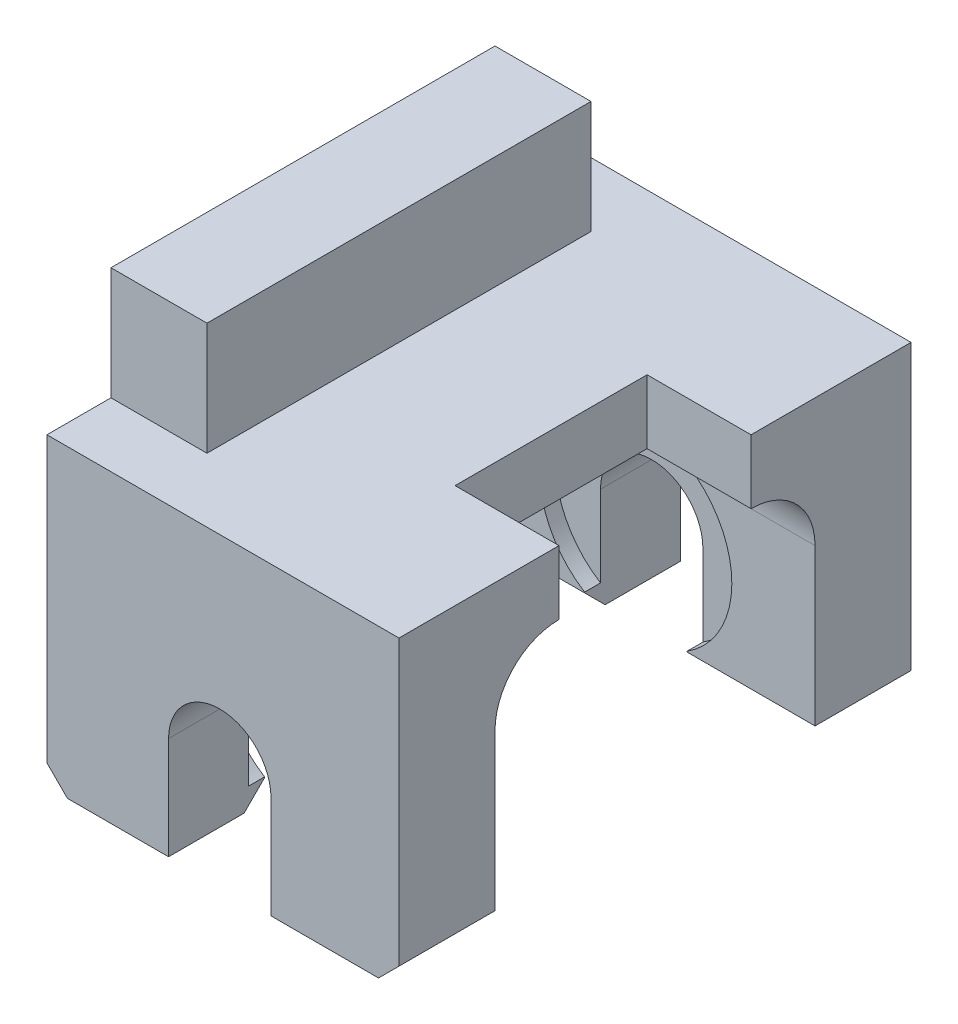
from build123d import *

# Parameters (mm, degrees)
BASE_EXTRUDE_DEPTH      = 25.4
BASE_EXTRUDE_DEPTH_BACK = 25.4
SKETCH2_W               = 31.75
SKETCH2_H               = 23.876
CUT_EXTRUDE1_DEPTH      = 54.300827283
SKETCH3_W               = 10.3124
SKETCH3_H               = 19.05
CUT_EXTRUDE2_DEPTH      = 44.300109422
FILLET1_R               = 6.35
CHAMFER1_SIZE           = 2.032
SKETCH5_R               = 9.525
CUT_EXTRUDE4_DEPTH      = 1.5748
SKETCH4_W               = 6.35
SKETCH4_H               = 11.176
CUT_EXTRUDE3_DEPTH      = 48.606539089


with BuildPart() as part:
    # Sketch1 → Base-Extrude (new, two sides: drawn at the far end of the back side and taken through both)
    with BuildSketch(Plane.XY.offset(-BASE_EXTRUDE_DEPTH_BACK)):
        with BuildLine():
            Line((-17.145, -10.16), (-17.145, 31.242))
            Line((-17.145, 31.242), (-7.62, 31.242))
            Line((-7.62, 31.242), (-7.62, 20.066))
            Line((-7.62, 20.066), (17.78, 20.066))
            Line((17.78, 20.066), (17.78, -10.16))
            Line((17.78, -10.16), (5.08, -10.16))
            Line((5.08, -10.16), (5.08, 0))
            ThreePointArc((5.08, 0), (0, 5.08), (-5.08, 0))
            Line((-5.08, 0), (-5.08, -10.16))
            Line((-5.08, -10.16), (-17.145, -10.16))
        make_face()
    extrude(amount=BASE_EXTRUDE_DEPTH + BASE_EXTRUDE_DEPTH_BACK)

    # Sketch2 → Cut-Extrude1 (cut, through all)
    with BuildSketch(Plane(origin=(17.78, 0, 0), x_dir=(0, 0, -1), z_dir=(1, 0, 0))):
        with Locations((0, 1.778)):
            Rectangle(SKETCH2_W, SKETCH2_H)
    extrude(amount=-CUT_EXTRUDE1_DEPTH, mode=Mode.SUBTRACT)

    # Sketch3 → Cut-Extrude2 (cut, through all)
    with BuildSketch(Plane(origin=(0, 20.066, 0), x_dir=(-1, 0, 0), z_dir=(0, 1, 0))):
        with Locations((-12.6238, 0)):
            Rectangle(SKETCH3_W, SKETCH3_H)
    extrude(amount=-CUT_EXTRUDE2_DEPTH, mode=Mode.SUBTRACT)

    # Fillet1
    fillet1_edges = [part.edges().sort_by_distance(p)[0] for p in [
        (0.3175, 13.716, 15.875),
        (0.3175, 13.716, -15.875),
    ]]
    fillet(fillet1_edges, radius=FILLET1_R)

    # Chamfer1
    chamfer1_edges = [part.edges().sort_by_distance(p)[0] for p in [
        (-17.145, -10.16, 20.6375),
        (-17.145, -10.16, -20.6375),
        (11.43, -10.16, 15.875),
        (-11.1125, -10.16, 15.875),
        (11.43, -10.16, -15.875),
        (-11.1125, -10.16, -15.875),
        (17.78, -10.16, 20.6375),
        (17.78, -10.16, -20.6375),
    ]]
    chamfer(chamfer1_edges, length=CHAMFER1_SIZE)

    # Sketch5 → Cut-Extrude4 (cut)
    with BuildSketch(Plane.XY.offset(-15.875)):
        Circle(SKETCH5_R)
    cut_extrude4 = extrude(amount=-CUT_EXTRUDE4_DEPTH, mode=Mode.SUBTRACT)

    # Sketch4 → Cut-Extrude3 (cut, through all)
    with BuildSketch(Plane(origin=(-7.62, 0, 0), x_dir=(0, 0, -1), z_dir=(1, 0, 0))):
        with Locations((-22.225, 25.654)):
            Rectangle(SKETCH4_W, SKETCH4_H)
        with Locations((22.225, 25.654)):
            Rectangle(SKETCH4_W, SKETCH4_H)
    extrude(amount=-CUT_EXTRUDE3_DEPTH, mode=Mode.SUBTRACT)

    # Mirror1: Cut-Extrude4 across plane
    add(cut_extrude4.mirror(Plane.XY), mode=Mode.SUBTRACT)


solid = part.part
